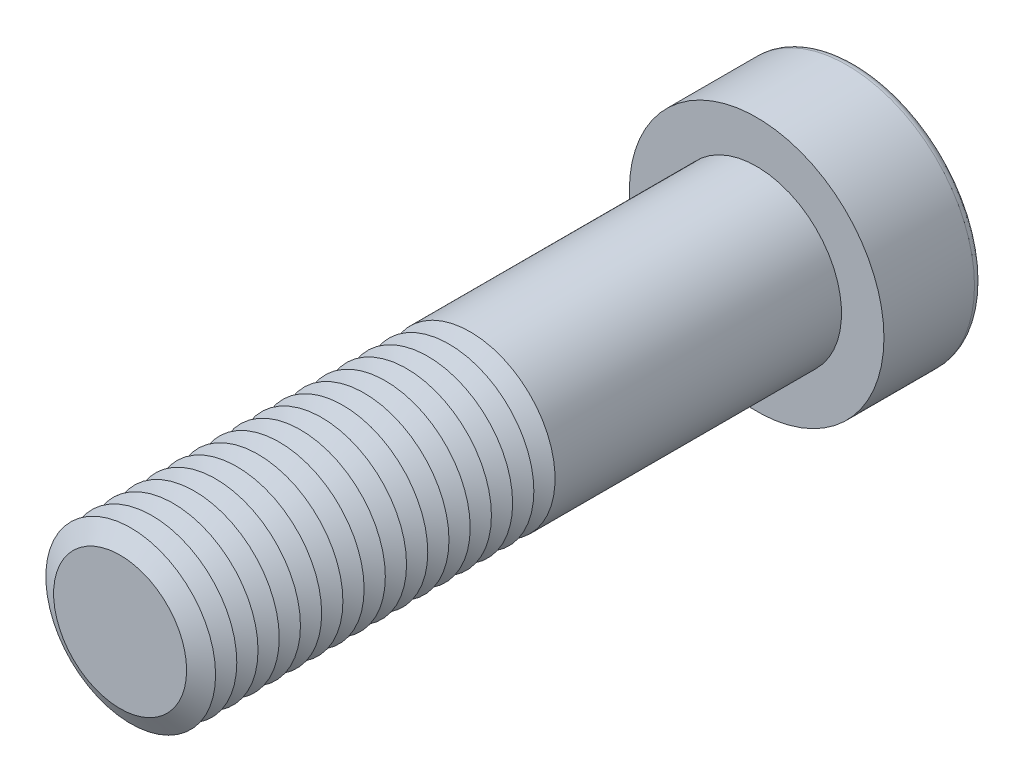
from build123d import *

# Parameters (mm, degrees)
SKETCH1_R           = 12
BOSS_EXTRUDE1_DEPTH = 90
SKETCH2_R           = 18
BOSS_EXTRUDE2_DEPTH = 14
CUT_EXTRUDE1_DEPTH  = 14.25
FILLET1_R           = 1.2
LPATTERN1_COUNT     = 17
LPATTERN1_PITCH     = 3


with BuildPart() as part:
    # Sketch1 → Boss-Extrude1 (new body)
    with BuildSketch(Plane.XY):
        with Locations(Location((0, 0, 0), (0, 0, 180))):
            Circle(SKETCH1_R)
    extrude(amount=BOSS_EXTRUDE1_DEPTH)

    # Sketch2 → Boss-Extrude2 (add)
    with BuildSketch(Plane(origin=(0, 0, 0), x_dir=(-1, 0, 0), z_dir=(0, 0, -1))):
        Circle(SKETCH2_R)
    extrude(amount=BOSS_EXTRUDE2_DEPTH)

    # Sketch3 → Cut-Extrude1 (cut)
    with BuildSketch(Plane(origin=(0, 0, -14), x_dir=(-1, 0, 0), z_dir=(0, 0, -1))):
        Polygon((-5.484827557, 9.5), (-10.969655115, 0), (-5.484827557, -9.5), (5.484827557, -9.5), (10.969655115, 0), (5.484827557, 9.5), align=None)
    extrude(amount=-CUT_EXTRUDE1_DEPTH, mode=Mode.SUBTRACT)

    # Fillet1
    fillet1_edges = [part.edges().sort_by_distance(p)[0] for p in [
        (18, 0, -14),
    ]]
    fillet(fillet1_edges, radius=FILLET1_R)

    # Cut-Extrude2 cone 1 section (on through the dimple's axis) → Cut-Extrude2 (revolve, cut)
    with BuildSketch(Plane(origin=(0, 0, 0.25), x_dir=(0, 1, 0), z_dir=(1, 0, 0))):
        Polygon((0, 0), (9.5, 0), (0, 5.484827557), align=None)
    revolve(axis=Axis((0, 0, 0.25), (0, 0, 1)), mode=Mode.SUBTRACT)

    # Cut-Extrude3 cone 1 section (on through the dimple's axis) → Cut-Extrude3 (revolve, cut)
    with BuildSketch(Plane(origin=(0, 0, -14), x_dir=(0, 1, 0), z_dir=(1, 0, 0))):
        Polygon((0, 0), (10.969655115, 0), (0, 2.939310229), align=None)
    revolve(axis=Axis((0, 0, -14), (0, 0, 1)), mode=Mode.SUBTRACT)

    # Sketch7 → Cut-Revolve1 (revolve, cut)
    with BuildSketch(Plane(origin=(0, 0, 0), x_dir=(0, 0, -1), z_dir=(1, 0, 0)), mode=Mode.PRIVATE) as cut_revolve1_sk:
        Polygon((-90, 9.401923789), (-88.5, 12), (-91.5, 12), align=None)
    cut_revolve1 = revolve(cut_revolve1_sk.sketch.rotate(Axis((0, 0, 90), (0, 0, -1)), 270), axis=Axis((0, 0, 90), (0, 0, -1)), mode=Mode.SUBTRACT)

    # LPattern1: Cut-Revolve1 ×17
    with Locations(*[(0, 0, -i * LPATTERN1_PITCH) for i in range(1, LPATTERN1_COUNT)]):
        add(cut_revolve1, mode=Mode.SUBTRACT)


solid = part.part
